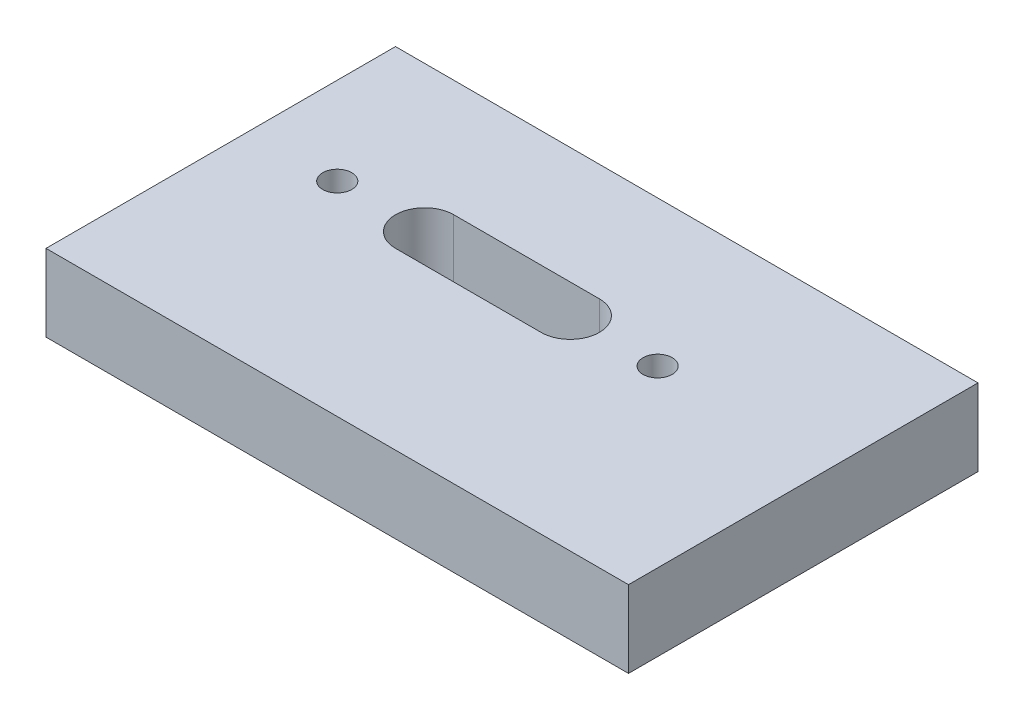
ISO-10303-21;
HEADER;
FILE_DESCRIPTION(('STEP AP214'),'2;1');
FILE_NAME('part.step','',(''),(''),'','','');
FILE_SCHEMA(('AUTOMOTIVE_DESIGN { 1 0 10303 214 1 1 1 1 }'));
ENDSEC;
DATA;
#1=APPLICATION_CONTEXT('core data for automotive mechanical design processes');
#2=APPLICATION_PROTOCOL_DEFINITION('international standard','automotive_design',2000,#1);
#3=PRODUCT_CONTEXT('',#1,'mechanical');
#4=PRODUCT('Part','Part','',(#3));
#5=PRODUCT_RELATED_PRODUCT_CATEGORY('part','',(#4));
#6=PRODUCT_DEFINITION_FORMATION('','',#4);
#7=PRODUCT_DEFINITION_CONTEXT('part definition',#1,'design');
#8=PRODUCT_DEFINITION('design','',#6,#7);
#9=PRODUCT_DEFINITION_SHAPE('','',#8);
#10=(LENGTH_UNIT() NAMED_UNIT(*) SI_UNIT(.MILLI.,.METRE.));
#11=(NAMED_UNIT(*) PLANE_ANGLE_UNIT() SI_UNIT($,.RADIAN.));
#12=(NAMED_UNIT(*) SI_UNIT($,.STERADIAN.) SOLID_ANGLE_UNIT());
#13=UNCERTAINTY_MEASURE_WITH_UNIT(LENGTH_MEASURE(1.E-05),#10,'distance_accuracy_value','');
#14=(GEOMETRIC_REPRESENTATION_CONTEXT(3) GLOBAL_UNCERTAINTY_ASSIGNED_CONTEXT((#13)) GLOBAL_UNIT_ASSIGNED_CONTEXT((#10,
#11,#12)) REPRESENTATION_CONTEXT('',''));
#15=CARTESIAN_POINT('',(0.,0.,0.));
#16=DIRECTION('',(0.,0.,1.));
#17=DIRECTION('',(1.,0.,0.));
#18=AXIS2_PLACEMENT_3D('',#15,#16,#17);
#19=CARTESIAN_POINT('',(63.5,16.764,38.1));
#20=DIRECTION('',(-1.,0.,0.));
#21=DIRECTION('',(0.,0.,1.));
#22=AXIS2_PLACEMENT_3D('',#19,#20,#21);
#23=PLANE('',#22);
#24=DIRECTION('',(0.,0.,-1.));
#25=VECTOR('',#24,1.);
#26=CARTESIAN_POINT('',(63.5,0.,38.1));
#27=LINE('',#26,#25);
#28=CARTESIAN_POINT('',(63.5,0.,38.1));
#29=VERTEX_POINT('',#28);
#30=CARTESIAN_POINT('',(63.5,0.,-38.1));
#31=VERTEX_POINT('',#30);
#32=EDGE_CURVE('E133',#29,#31,#27,.T.);
#33=ORIENTED_EDGE('',*,*,#32,.T.);
#34=DIRECTION('',(0.,-1.,0.));
#35=VECTOR('',#34,1.);
#36=CARTESIAN_POINT('',(63.5,16.764,-38.1));
#37=LINE('',#36,#35);
#38=CARTESIAN_POINT('',(63.5,16.764,-38.1));
#39=VERTEX_POINT('',#38);
#40=EDGE_CURVE('E11',#39,#31,#37,.T.);
#41=ORIENTED_EDGE('',*,*,#40,.F.);
#42=DIRECTION('',(0.,0.,-1.));
#43=VECTOR('',#42,1.);
#44=CARTESIAN_POINT('',(63.5,16.764,38.1));
#45=LINE('',#44,#43);
#46=CARTESIAN_POINT('',(63.5,16.764,38.1));
#47=VERTEX_POINT('',#46);
#48=EDGE_CURVE('E137',#47,#39,#45,.T.);
#49=ORIENTED_EDGE('',*,*,#48,.F.);
#50=DIRECTION('',(0.,-1.,0.));
#51=VECTOR('',#50,1.);
#52=CARTESIAN_POINT('',(63.5,16.764,38.1));
#53=LINE('',#52,#51);
#54=EDGE_CURVE('E147',#47,#29,#53,.T.);
#55=ORIENTED_EDGE('',*,*,#54,.T.);
#56=EDGE_LOOP('',(#33,#41,#49,#55));
#57=FACE_BOUND('',#56,.T.);
#58=ADVANCED_FACE('F32',(#57),#23,.F.);
#59=CARTESIAN_POINT('',(-63.5,16.764,-38.1));
#60=DIRECTION('',(0.,0.,1.));
#61=DIRECTION('',(1.,0.,0.));
#62=AXIS2_PLACEMENT_3D('',#59,#60,#61);
#63=PLANE('',#62);
#64=DIRECTION('',(-1.,0.,0.));
#65=VECTOR('',#64,1.);
#66=CARTESIAN_POINT('',(-63.5,0.,-38.1));
#67=LINE('',#66,#65);
#68=CARTESIAN_POINT('',(-63.5,0.,-38.1));
#69=VERTEX_POINT('',#68);
#70=EDGE_CURVE('E150',#31,#69,#67,.T.);
#71=ORIENTED_EDGE('',*,*,#70,.T.);
#72=DIRECTION('',(0.,-1.,0.));
#73=VECTOR('',#72,1.);
#74=CARTESIAN_POINT('',(-63.5,16.764,-38.1));
#75=LINE('',#74,#73);
#76=CARTESIAN_POINT('',(-63.5,16.764,-38.1));
#77=VERTEX_POINT('',#76);
#78=EDGE_CURVE('E39',#77,#69,#75,.T.);
#79=ORIENTED_EDGE('',*,*,#78,.F.);
#80=DIRECTION('',(-1.,0.,0.));
#81=VECTOR('',#80,1.);
#82=CARTESIAN_POINT('',(-63.5,16.764,-38.1));
#83=LINE('',#82,#81);
#84=EDGE_CURVE('E140',#39,#77,#83,.T.);
#85=ORIENTED_EDGE('',*,*,#84,.F.);
#86=ORIENTED_EDGE('',*,*,#40,.T.);
#87=EDGE_LOOP('',(#71,#79,#85,#86));
#88=FACE_BOUND('',#87,.T.);
#89=ADVANCED_FACE('F178',(#88),#63,.F.);
#90=CARTESIAN_POINT('',(-63.5,16.764,38.1));
#91=DIRECTION('',(1.,0.,0.));
#92=DIRECTION('',(0.,0.,-1.));
#93=AXIS2_PLACEMENT_3D('',#90,#91,#92);
#94=PLANE('',#93);
#95=DIRECTION('',(0.,0.,1.));
#96=VECTOR('',#95,1.);
#97=CARTESIAN_POINT('',(-63.5,0.,38.1));
#98=LINE('',#97,#96);
#99=CARTESIAN_POINT('',(-63.5,0.,38.1));
#100=VERTEX_POINT('',#99);
#101=EDGE_CURVE('E152',#69,#100,#98,.T.);
#102=ORIENTED_EDGE('',*,*,#101,.T.);
#103=DIRECTION('',(0.,-1.,0.));
#104=VECTOR('',#103,1.);
#105=CARTESIAN_POINT('',(-63.5,16.764,38.1));
#106=LINE('',#105,#104);
#107=CARTESIAN_POINT('',(-63.5,16.764,38.1));
#108=VERTEX_POINT('',#107);
#109=EDGE_CURVE('E157',#108,#100,#106,.T.);
#110=ORIENTED_EDGE('',*,*,#109,.F.);
#111=DIRECTION('',(0.,0.,1.));
#112=VECTOR('',#111,1.);
#113=CARTESIAN_POINT('',(-63.5,16.764,38.1));
#114=LINE('',#113,#112);
#115=EDGE_CURVE('E143',#77,#108,#114,.T.);
#116=ORIENTED_EDGE('',*,*,#115,.F.);
#117=ORIENTED_EDGE('',*,*,#78,.T.);
#118=EDGE_LOOP('',(#102,#110,#116,#117));
#119=FACE_BOUND('',#118,.T.);
#120=ADVANCED_FACE('F164',(#119),#94,.F.);
#121=CARTESIAN_POINT('',(-63.5,16.764,38.1));
#122=DIRECTION('',(0.,0.,-1.));
#123=DIRECTION('',(-1.,0.,0.));
#124=AXIS2_PLACEMENT_3D('',#121,#122,#123);
#125=PLANE('',#124);
#126=DIRECTION('',(1.,0.,0.));
#127=VECTOR('',#126,1.);
#128=CARTESIAN_POINT('',(-63.5,0.,38.1));
#129=LINE('',#128,#127);
#130=EDGE_CURVE('E141',#100,#29,#129,.T.);
#131=ORIENTED_EDGE('',*,*,#130,.T.);
#132=ORIENTED_EDGE('',*,*,#54,.F.);
#133=DIRECTION('',(1.,0.,0.));
#134=VECTOR('',#133,1.);
#135=CARTESIAN_POINT('',(-63.5,16.764,38.1));
#136=LINE('',#135,#134);
#137=EDGE_CURVE('E145',#108,#47,#136,.T.);
#138=ORIENTED_EDGE('',*,*,#137,.F.);
#139=ORIENTED_EDGE('',*,*,#109,.T.);
#140=EDGE_LOOP('',(#131,#132,#138,#139));
#141=FACE_BOUND('',#140,.T.);
#142=ADVANCED_FACE('F171',(#141),#125,.F.);
#143=CARTESIAN_POINT('',(0.,16.764,0.));
#144=DIRECTION('',(0.,-1.,0.));
#145=DIRECTION('',(0.,0.,-1.));
#146=AXIS2_PLACEMENT_3D('',#143,#144,#145);
#147=PLANE('',#146);
#148=CARTESIAN_POINT('',(-44.45,16.764,-6.35));
#149=DIRECTION('',(0.,1.,0.));
#150=DIRECTION('',(0.,0.,-1.));
#151=AXIS2_PLACEMENT_3D('',#148,#149,#150);
#152=CIRCLE('',#151,3.175);
#153=CARTESIAN_POINT('',(-44.45,16.764,-9.525));
#154=VERTEX_POINT('',#153);
#155=EDGE_CURVE('E220',#154,#154,#152,.T.);
#156=ORIENTED_EDGE('',*,*,#155,.F.);
#157=EDGE_LOOP('',(#156));
#158=FACE_BOUND('',#157,.T.);
#159=CARTESIAN_POINT('',(25.4,16.764,-6.35));
#160=DIRECTION('',(0.,1.,0.));
#161=DIRECTION('',(0.,0.,1.));
#162=AXIS2_PLACEMENT_3D('',#159,#160,#161);
#163=CIRCLE('',#162,3.175);
#164=CARTESIAN_POINT('',(25.4,16.764,-3.175));
#165=VERTEX_POINT('',#164);
#166=EDGE_CURVE('E120',#165,#165,#163,.T.);
#167=ORIENTED_EDGE('',*,*,#166,.F.);
#168=EDGE_LOOP('',(#167));
#169=FACE_BOUND('',#168,.T.);
#170=DIRECTION('',(1.,0.,0.));
#171=VECTOR('',#170,1.);
#172=CARTESIAN_POINT('',(-25.4,16.764,0.));
#173=LINE('',#172,#171);
#174=CARTESIAN_POINT('',(-25.4,16.764,0.));
#175=VERTEX_POINT('',#174);
#176=CARTESIAN_POINT('',(6.35,16.764,0.));
#177=VERTEX_POINT('',#176);
#178=EDGE_CURVE('E126',#175,#177,#173,.T.);
#179=ORIENTED_EDGE('',*,*,#178,.F.);
#180=CARTESIAN_POINT('',(-25.4,16.764,-6.35));
#181=DIRECTION('',(0.,1.,0.));
#182=DIRECTION('',(0.,0.,1.));
#183=AXIS2_PLACEMENT_3D('',#180,#181,#182);
#184=CIRCLE('',#183,6.35);
#185=CARTESIAN_POINT('',(-25.4,16.764,-12.7));
#186=VERTEX_POINT('',#185);
#187=EDGE_CURVE('E46',#186,#175,#184,.T.);
#188=ORIENTED_EDGE('',*,*,#187,.F.);
#189=DIRECTION('',(-1.,0.,0.));
#190=VECTOR('',#189,1.);
#191=CARTESIAN_POINT('',(-25.4,16.764,-12.7));
#192=LINE('',#191,#190);
#193=CARTESIAN_POINT('',(6.35,16.764,-12.7));
#194=VERTEX_POINT('',#193);
#195=EDGE_CURVE('E114',#194,#186,#192,.T.);
#196=ORIENTED_EDGE('',*,*,#195,.F.);
#197=CARTESIAN_POINT('',(6.35,16.764,-6.35));
#198=DIRECTION('',(0.,1.,0.));
#199=DIRECTION('',(0.,0.,1.));
#200=AXIS2_PLACEMENT_3D('',#197,#198,#199);
#201=CIRCLE('',#200,6.35);
#202=EDGE_CURVE('E117',#177,#194,#201,.T.);
#203=ORIENTED_EDGE('',*,*,#202,.F.);
#204=EDGE_LOOP('',(#179,#188,#196,#203));
#205=FACE_BOUND('',#204,.T.);
#206=ORIENTED_EDGE('',*,*,#48,.T.);
#207=ORIENTED_EDGE('',*,*,#84,.T.);
#208=ORIENTED_EDGE('',*,*,#115,.T.);
#209=ORIENTED_EDGE('',*,*,#137,.T.);
#210=EDGE_LOOP('',(#206,#207,#208,#209));
#211=FACE_BOUND('',#210,.T.);
#212=ADVANCED_FACE('F177',(#158,#169,#205,#211),#147,.F.);
#213=CARTESIAN_POINT('',(0.,0.,0.));
#214=DIRECTION('',(0.,-1.,0.));
#215=DIRECTION('',(0.,0.,-1.));
#216=AXIS2_PLACEMENT_3D('',#213,#214,#215);
#217=PLANE('',#216);
#218=CARTESIAN_POINT('',(-44.45,0.,-6.35));
#219=DIRECTION('',(0.,1.,0.));
#220=DIRECTION('',(0.,0.,-1.));
#221=AXIS2_PLACEMENT_3D('',#218,#219,#220);
#222=CIRCLE('',#221,3.175);
#223=CARTESIAN_POINT('',(-44.45,0.,-9.525));
#224=VERTEX_POINT('',#223);
#225=EDGE_CURVE('E217',#224,#224,#222,.T.);
#226=ORIENTED_EDGE('',*,*,#225,.T.);
#227=EDGE_LOOP('',(#226));
#228=FACE_BOUND('',#227,.T.);
#229=CARTESIAN_POINT('',(25.4,0.,-6.35));
#230=DIRECTION('',(0.,1.,0.));
#231=DIRECTION('',(0.,0.,1.));
#232=AXIS2_PLACEMENT_3D('',#229,#230,#231);
#233=CIRCLE('',#232,3.175);
#234=CARTESIAN_POINT('',(25.4,0.,-3.175));
#235=VERTEX_POINT('',#234);
#236=EDGE_CURVE('E127',#235,#235,#233,.T.);
#237=ORIENTED_EDGE('',*,*,#236,.T.);
#238=EDGE_LOOP('',(#237));
#239=FACE_BOUND('',#238,.T.);
#240=CARTESIAN_POINT('',(-25.4,0.,-6.35));
#241=DIRECTION('',(0.,1.,0.));
#242=DIRECTION('',(0.,0.,1.));
#243=AXIS2_PLACEMENT_3D('',#240,#241,#242);
#244=CIRCLE('',#243,6.35);
#245=CARTESIAN_POINT('',(-25.4,0.,-12.7));
#246=VERTEX_POINT('',#245);
#247=CARTESIAN_POINT('',(-25.4,0.,0.));
#248=VERTEX_POINT('',#247);
#249=EDGE_CURVE('E98',#246,#248,#244,.T.);
#250=ORIENTED_EDGE('',*,*,#249,.T.);
#251=DIRECTION('',(1.,0.,0.));
#252=VECTOR('',#251,1.);
#253=CARTESIAN_POINT('',(-25.4,0.,0.));
#254=LINE('',#253,#252);
#255=CARTESIAN_POINT('',(6.35,0.,0.));
#256=VERTEX_POINT('',#255);
#257=EDGE_CURVE('E107',#248,#256,#254,.T.);
#258=ORIENTED_EDGE('',*,*,#257,.T.);
#259=CARTESIAN_POINT('',(6.35,0.,-6.35));
#260=DIRECTION('',(0.,1.,0.));
#261=DIRECTION('',(0.,0.,1.));
#262=AXIS2_PLACEMENT_3D('',#259,#260,#261);
#263=CIRCLE('',#262,6.35);
#264=CARTESIAN_POINT('',(6.35,0.,-12.7));
#265=VERTEX_POINT('',#264);
#266=EDGE_CURVE('E54',#256,#265,#263,.T.);
#267=ORIENTED_EDGE('',*,*,#266,.T.);
#268=DIRECTION('',(-1.,0.,0.));
#269=VECTOR('',#268,1.);
#270=CARTESIAN_POINT('',(-25.4,0.,-12.7));
#271=LINE('',#270,#269);
#272=EDGE_CURVE('E104',#265,#246,#271,.T.);
#273=ORIENTED_EDGE('',*,*,#272,.T.);
#274=EDGE_LOOP('',(#250,#258,#267,#273));
#275=FACE_BOUND('',#274,.T.);
#276=ORIENTED_EDGE('',*,*,#32,.F.);
#277=ORIENTED_EDGE('',*,*,#130,.F.);
#278=ORIENTED_EDGE('',*,*,#101,.F.);
#279=ORIENTED_EDGE('',*,*,#70,.F.);
#280=EDGE_LOOP('',(#276,#277,#278,#279));
#281=FACE_BOUND('',#280,.T.);
#282=ADVANCED_FACE('F111',(#228,#239,#275,#281),#217,.T.);
#283=CARTESIAN_POINT('',(-25.4,0.,-6.35));
#284=DIRECTION('',(0.,1.,0.));
#285=DIRECTION('',(0.,0.,1.));
#286=AXIS2_PLACEMENT_3D('',#283,#284,#285);
#287=CYLINDRICAL_SURFACE('',#286,6.35);
#288=ORIENTED_EDGE('',*,*,#187,.T.);
#289=DIRECTION('',(0.,1.,0.));
#290=VECTOR('',#289,1.);
#291=CARTESIAN_POINT('',(-25.4,0.,0.));
#292=LINE('',#291,#290);
#293=EDGE_CURVE('E94',#248,#175,#292,.T.);
#294=ORIENTED_EDGE('',*,*,#293,.F.);
#295=ORIENTED_EDGE('',*,*,#249,.F.);
#296=DIRECTION('',(0.,1.,0.));
#297=VECTOR('',#296,1.);
#298=CARTESIAN_POINT('',(-25.4,0.,-12.7));
#299=LINE('',#298,#297);
#300=EDGE_CURVE('E131',#246,#186,#299,.T.);
#301=ORIENTED_EDGE('',*,*,#300,.T.);
#302=EDGE_LOOP('',(#288,#294,#295,#301));
#303=FACE_BOUND('',#302,.T.);
#304=ADVANCED_FACE('F96',(#303),#287,.F.);
#305=CARTESIAN_POINT('',(-25.4,0.,-12.7));
#306=DIRECTION('',(0.,0.,-1.));
#307=DIRECTION('',(-1.,0.,0.));
#308=AXIS2_PLACEMENT_3D('',#305,#306,#307);
#309=PLANE('',#308);
#310=ORIENTED_EDGE('',*,*,#195,.T.);
#311=ORIENTED_EDGE('',*,*,#300,.F.);
#312=ORIENTED_EDGE('',*,*,#272,.F.);
#313=DIRECTION('',(0.,1.,0.));
#314=VECTOR('',#313,1.);
#315=CARTESIAN_POINT('',(6.35,0.,-12.7));
#316=LINE('',#315,#314);
#317=EDGE_CURVE('E134',#265,#194,#316,.T.);
#318=ORIENTED_EDGE('',*,*,#317,.T.);
#319=EDGE_LOOP('',(#310,#311,#312,#318));
#320=FACE_BOUND('',#319,.T.);
#321=ADVANCED_FACE('F196',(#320),#309,.F.);
#322=CARTESIAN_POINT('',(6.35,0.,-6.35));
#323=DIRECTION('',(0.,1.,0.));
#324=DIRECTION('',(0.,0.,1.));
#325=AXIS2_PLACEMENT_3D('',#322,#323,#324);
#326=CYLINDRICAL_SURFACE('',#325,6.35);
#327=ORIENTED_EDGE('',*,*,#202,.T.);
#328=ORIENTED_EDGE('',*,*,#317,.F.);
#329=ORIENTED_EDGE('',*,*,#266,.F.);
#330=DIRECTION('',(0.,1.,0.));
#331=VECTOR('',#330,1.);
#332=CARTESIAN_POINT('',(6.35,0.,0.));
#333=LINE('',#332,#331);
#334=EDGE_CURVE('E103',#256,#177,#333,.T.);
#335=ORIENTED_EDGE('',*,*,#334,.T.);
#336=EDGE_LOOP('',(#327,#328,#329,#335));
#337=FACE_BOUND('',#336,.T.);
#338=ADVANCED_FACE('F200',(#337),#326,.F.);
#339=CARTESIAN_POINT('',(-25.4,0.,0.));
#340=DIRECTION('',(0.,0.,1.));
#341=DIRECTION('',(1.,0.,0.));
#342=AXIS2_PLACEMENT_3D('',#339,#340,#341);
#343=PLANE('',#342);
#344=ORIENTED_EDGE('',*,*,#178,.T.);
#345=ORIENTED_EDGE('',*,*,#334,.F.);
#346=ORIENTED_EDGE('',*,*,#257,.F.);
#347=ORIENTED_EDGE('',*,*,#293,.T.);
#348=EDGE_LOOP('',(#344,#345,#346,#347));
#349=FACE_BOUND('',#348,.T.);
#350=ADVANCED_FACE('F108',(#349),#343,.F.);
#351=CARTESIAN_POINT('',(25.4,0.,-6.35));
#352=DIRECTION('',(0.,1.,0.));
#353=DIRECTION('',(0.,0.,1.));
#354=AXIS2_PLACEMENT_3D('',#351,#352,#353);
#355=CYLINDRICAL_SURFACE('',#354,3.175);
#356=ORIENTED_EDGE('',*,*,#236,.F.);
#357=EDGE_LOOP('',(#356));
#358=FACE_BOUND('',#357,.T.);
#359=ORIENTED_EDGE('',*,*,#166,.T.);
#360=EDGE_LOOP('',(#359));
#361=FACE_BOUND('',#360,.T.);
#362=ADVANCED_FACE('F199',(#358,#361),#355,.F.);
#363=CARTESIAN_POINT('',(-44.45,0.,-6.35));
#364=DIRECTION('',(0.,1.,0.));
#365=DIRECTION('',(0.,0.,1.));
#366=AXIS2_PLACEMENT_3D('',#363,#364,#365);
#367=CYLINDRICAL_SURFACE('',#366,3.175);
#368=ORIENTED_EDGE('',*,*,#225,.F.);
#369=EDGE_LOOP('',(#368));
#370=FACE_BOUND('',#369,.T.);
#371=ORIENTED_EDGE('',*,*,#155,.T.);
#372=EDGE_LOOP('',(#371));
#373=FACE_BOUND('',#372,.T.);
#374=ADVANCED_FACE('F208',(#370,#373),#367,.F.);
#375=CLOSED_SHELL('',(#58,#89,#120,#142,#212,#282,#304,#321,#338,#350,#362,#374));
#376=MANIFOLD_SOLID_BREP('B2',#375);
#377=ADVANCED_BREP_SHAPE_REPRESENTATION('',(#18,#376),#14);
#378=SHAPE_DEFINITION_REPRESENTATION(#9,#377);
ENDSEC;
END-ISO-10303-21;
